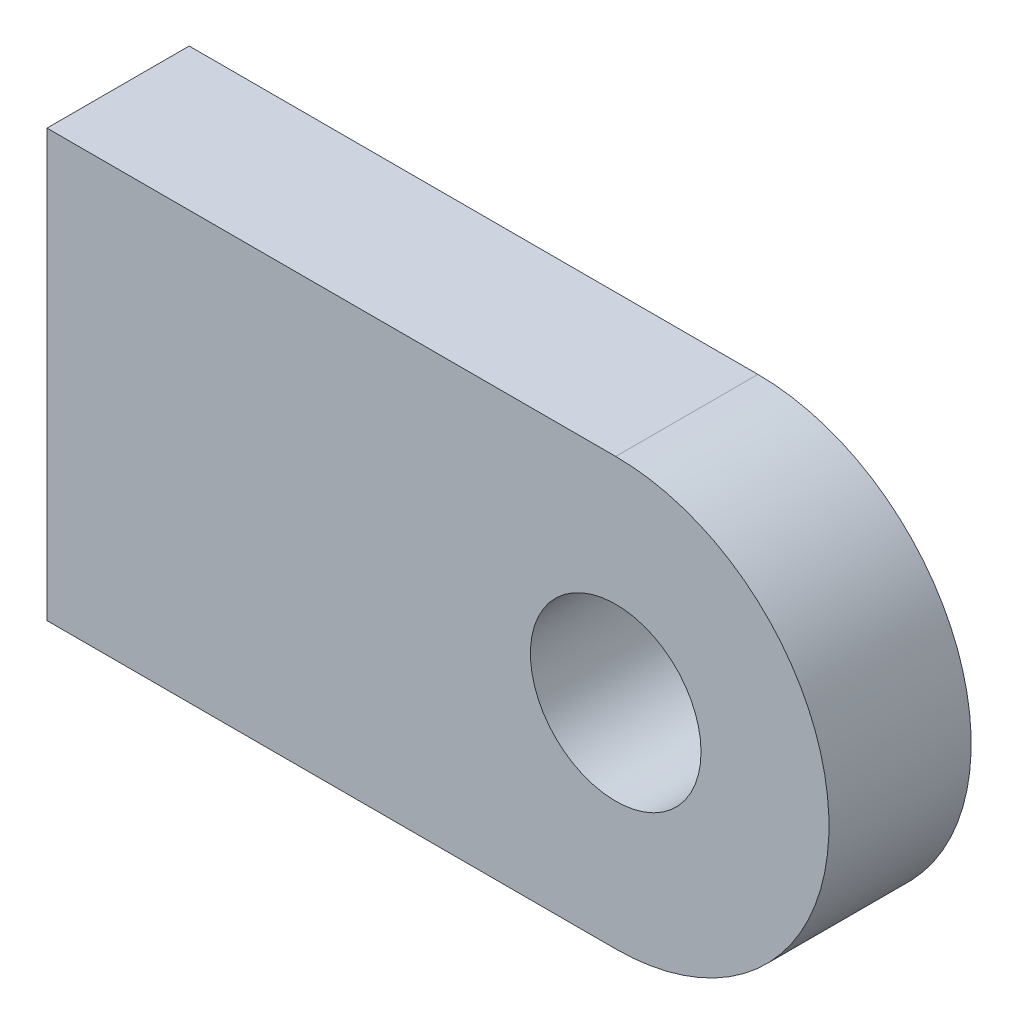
ISO-10303-21;
HEADER;
FILE_DESCRIPTION(('STEP AP214'),'2;1');
FILE_NAME('part.step','',(''),(''),'','','');
FILE_SCHEMA(('AUTOMOTIVE_DESIGN { 1 0 10303 214 1 1 1 1 }'));
ENDSEC;
DATA;
#1=APPLICATION_CONTEXT('core data for automotive mechanical design processes');
#2=APPLICATION_PROTOCOL_DEFINITION('international standard','automotive_design',2000,#1);
#3=PRODUCT_CONTEXT('',#1,'mechanical');
#4=PRODUCT('Part','Part','',(#3));
#5=PRODUCT_RELATED_PRODUCT_CATEGORY('part','',(#4));
#6=PRODUCT_DEFINITION_FORMATION('','',#4);
#7=PRODUCT_DEFINITION_CONTEXT('part definition',#1,'design');
#8=PRODUCT_DEFINITION('design','',#6,#7);
#9=PRODUCT_DEFINITION_SHAPE('','',#8);
#10=(LENGTH_UNIT() NAMED_UNIT(*) SI_UNIT(.MILLI.,.METRE.));
#11=(NAMED_UNIT(*) PLANE_ANGLE_UNIT() SI_UNIT($,.RADIAN.));
#12=(NAMED_UNIT(*) SI_UNIT($,.STERADIAN.) SOLID_ANGLE_UNIT());
#13=UNCERTAINTY_MEASURE_WITH_UNIT(LENGTH_MEASURE(1.E-05),#10,'distance_accuracy_value','');
#14=(GEOMETRIC_REPRESENTATION_CONTEXT(3) GLOBAL_UNCERTAINTY_ASSIGNED_CONTEXT((#13)) GLOBAL_UNIT_ASSIGNED_CONTEXT((#10,
#11,#12)) REPRESENTATION_CONTEXT('',''));
#15=CARTESIAN_POINT('',(0.,0.,0.));
#16=DIRECTION('',(0.,0.,1.));
#17=DIRECTION('',(1.,0.,0.));
#18=AXIS2_PLACEMENT_3D('',#15,#16,#17);
#19=CARTESIAN_POINT('',(0.,0.,10.));
#20=DIRECTION('',(1.,0.,0.));
#21=DIRECTION('',(0.,1.,0.));
#22=AXIS2_PLACEMENT_3D('',#19,#20,#21);
#23=PLANE('',#22);
#24=DIRECTION('',(0.,-1.,0.));
#25=VECTOR('',#24,1.);
#26=CARTESIAN_POINT('',(0.,0.,0.));
#27=LINE('',#26,#25);
#28=CARTESIAN_POINT('',(0.,0.,0.));
#29=VERTEX_POINT('',#28);
#30=CARTESIAN_POINT('',(0.,-30.,0.));
#31=VERTEX_POINT('',#30);
#32=EDGE_CURVE('E93',#29,#31,#27,.T.);
#33=ORIENTED_EDGE('',*,*,#32,.T.);
#34=DIRECTION('',(0.,0.,-1.));
#35=VECTOR('',#34,1.);
#36=CARTESIAN_POINT('',(0.,-30.,10.));
#37=LINE('',#36,#35);
#38=CARTESIAN_POINT('',(0.,-30.,10.));
#39=VERTEX_POINT('',#38);
#40=EDGE_CURVE('E11',#39,#31,#37,.T.);
#41=ORIENTED_EDGE('',*,*,#40,.F.);
#42=DIRECTION('',(0.,-1.,0.));
#43=VECTOR('',#42,1.);
#44=CARTESIAN_POINT('',(0.,0.,10.));
#45=LINE('',#44,#43);
#46=CARTESIAN_POINT('',(0.,0.,10.));
#47=VERTEX_POINT('',#46);
#48=EDGE_CURVE('E81',#47,#39,#45,.T.);
#49=ORIENTED_EDGE('',*,*,#48,.F.);
#50=DIRECTION('',(0.,0.,-1.));
#51=VECTOR('',#50,1.);
#52=CARTESIAN_POINT('',(0.,0.,10.));
#53=LINE('',#52,#51);
#54=EDGE_CURVE('E89',#47,#29,#53,.T.);
#55=ORIENTED_EDGE('',*,*,#54,.T.);
#56=EDGE_LOOP('',(#33,#41,#49,#55));
#57=FACE_BOUND('',#56,.T.);
#58=ADVANCED_FACE('F30',(#57),#23,.F.);
#59=CARTESIAN_POINT('',(0.,-30.,10.));
#60=DIRECTION('',(0.,1.,0.));
#61=DIRECTION('',(0.,0.,1.));
#62=AXIS2_PLACEMENT_3D('',#59,#60,#61);
#63=PLANE('',#62);
#64=DIRECTION('',(1.,0.,0.));
#65=VECTOR('',#64,1.);
#66=CARTESIAN_POINT('',(0.,-30.,0.));
#67=LINE('',#66,#65);
#68=CARTESIAN_POINT('',(40.,-30.,0.));
#69=VERTEX_POINT('',#68);
#70=EDGE_CURVE('E85',#31,#69,#67,.T.);
#71=ORIENTED_EDGE('',*,*,#70,.T.);
#72=DIRECTION('',(0.,0.,-1.));
#73=VECTOR('',#72,1.);
#74=CARTESIAN_POINT('',(40.,-30.,10.));
#75=LINE('',#74,#73);
#76=CARTESIAN_POINT('',(40.,-30.,10.));
#77=VERTEX_POINT('',#76);
#78=EDGE_CURVE('E38',#77,#69,#75,.T.);
#79=ORIENTED_EDGE('',*,*,#78,.F.);
#80=DIRECTION('',(1.,0.,0.));
#81=VECTOR('',#80,1.);
#82=CARTESIAN_POINT('',(0.,-30.,10.));
#83=LINE('',#82,#81);
#84=EDGE_CURVE('E76',#39,#77,#83,.T.);
#85=ORIENTED_EDGE('',*,*,#84,.F.);
#86=ORIENTED_EDGE('',*,*,#40,.T.);
#87=EDGE_LOOP('',(#71,#79,#85,#86));
#88=FACE_BOUND('',#87,.T.);
#89=ADVANCED_FACE('F84',(#88),#63,.F.);
#90=CARTESIAN_POINT('',(40.,-15.,10.));
#91=DIRECTION('',(0.,0.,-1.));
#92=DIRECTION('',(-1.,0.,0.));
#93=AXIS2_PLACEMENT_3D('',#90,#91,#92);
#94=CYLINDRICAL_SURFACE('',#93,15.);
#95=CARTESIAN_POINT('',(40.,-15.,0.));
#96=DIRECTION('',(0.,0.,1.));
#97=DIRECTION('',(1.,0.,0.));
#98=AXIS2_PLACEMENT_3D('',#95,#96,#97);
#99=CIRCLE('',#98,15.);
#100=CARTESIAN_POINT('',(40.,0.,0.));
#101=VERTEX_POINT('',#100);
#102=EDGE_CURVE('E63',#69,#101,#99,.T.);
#103=ORIENTED_EDGE('',*,*,#102,.T.);
#104=DIRECTION('',(0.,0.,-1.));
#105=VECTOR('',#104,1.);
#106=CARTESIAN_POINT('',(40.,0.,10.));
#107=LINE('',#106,#105);
#108=CARTESIAN_POINT('',(40.,0.,10.));
#109=VERTEX_POINT('',#108);
#110=EDGE_CURVE('E86',#109,#101,#107,.T.);
#111=ORIENTED_EDGE('',*,*,#110,.F.);
#112=CARTESIAN_POINT('',(40.,-15.,10.));
#113=DIRECTION('',(0.,0.,1.));
#114=DIRECTION('',(1.,0.,0.));
#115=AXIS2_PLACEMENT_3D('',#112,#113,#114);
#116=CIRCLE('',#115,15.);
#117=EDGE_CURVE('E79',#77,#109,#116,.T.);
#118=ORIENTED_EDGE('',*,*,#117,.F.);
#119=ORIENTED_EDGE('',*,*,#78,.T.);
#120=EDGE_LOOP('',(#103,#111,#118,#119));
#121=FACE_BOUND('',#120,.T.);
#122=ADVANCED_FACE('F87',(#121),#94,.T.);
#123=CARTESIAN_POINT('',(0.,0.,10.));
#124=DIRECTION('',(0.,-1.,0.));
#125=DIRECTION('',(0.,0.,-1.));
#126=AXIS2_PLACEMENT_3D('',#123,#124,#125);
#127=PLANE('',#126);
#128=DIRECTION('',(-1.,0.,0.));
#129=VECTOR('',#128,1.);
#130=CARTESIAN_POINT('',(0.,0.,0.));
#131=LINE('',#130,#129);
#132=EDGE_CURVE('E69',#101,#29,#131,.T.);
#133=ORIENTED_EDGE('',*,*,#132,.T.);
#134=ORIENTED_EDGE('',*,*,#54,.F.);
#135=DIRECTION('',(-1.,0.,0.));
#136=VECTOR('',#135,1.);
#137=CARTESIAN_POINT('',(0.,0.,10.));
#138=LINE('',#137,#136);
#139=EDGE_CURVE('E46',#109,#47,#138,.T.);
#140=ORIENTED_EDGE('',*,*,#139,.F.);
#141=ORIENTED_EDGE('',*,*,#110,.T.);
#142=EDGE_LOOP('',(#133,#134,#140,#141));
#143=FACE_BOUND('',#142,.T.);
#144=ADVANCED_FACE('F101',(#143),#127,.F.);
#145=CARTESIAN_POINT('',(40.,-15.,10.));
#146=DIRECTION('',(0.,0.,1.));
#147=DIRECTION('',(1.,0.,0.));
#148=AXIS2_PLACEMENT_3D('',#145,#146,#147);
#149=PLANE('',#148);
#150=CARTESIAN_POINT('',(40.,-15.,10.));
#151=DIRECTION('',(0.,0.,1.));
#152=DIRECTION('',(1.,0.,0.));
#153=AXIS2_PLACEMENT_3D('',#150,#151,#152);
#154=CIRCLE('',#153,6.);
#155=CARTESIAN_POINT('',(46.,-15.,10.));
#156=VERTEX_POINT('',#155);
#157=EDGE_CURVE('E107',#156,#156,#154,.T.);
#158=ORIENTED_EDGE('',*,*,#157,.F.);
#159=EDGE_LOOP('',(#158));
#160=FACE_BOUND('',#159,.T.);
#161=ORIENTED_EDGE('',*,*,#48,.T.);
#162=ORIENTED_EDGE('',*,*,#84,.T.);
#163=ORIENTED_EDGE('',*,*,#117,.T.);
#164=ORIENTED_EDGE('',*,*,#139,.T.);
#165=EDGE_LOOP('',(#161,#162,#163,#164));
#166=FACE_BOUND('',#165,.T.);
#167=ADVANCED_FACE('F77',(#160,#166),#149,.T.);
#168=CARTESIAN_POINT('',(40.,-15.,0.));
#169=DIRECTION('',(0.,0.,1.));
#170=DIRECTION('',(1.,0.,0.));
#171=AXIS2_PLACEMENT_3D('',#168,#169,#170);
#172=PLANE('',#171);
#173=CARTESIAN_POINT('',(40.,-15.,0.));
#174=DIRECTION('',(0.,0.,1.));
#175=DIRECTION('',(1.,0.,0.));
#176=AXIS2_PLACEMENT_3D('',#173,#174,#175);
#177=CIRCLE('',#176,6.);
#178=CARTESIAN_POINT('',(46.,-15.,0.));
#179=VERTEX_POINT('',#178);
#180=EDGE_CURVE('E96',#179,#179,#177,.T.);
#181=ORIENTED_EDGE('',*,*,#180,.T.);
#182=EDGE_LOOP('',(#181));
#183=FACE_BOUND('',#182,.T.);
#184=ORIENTED_EDGE('',*,*,#32,.F.);
#185=ORIENTED_EDGE('',*,*,#132,.F.);
#186=ORIENTED_EDGE('',*,*,#102,.F.);
#187=ORIENTED_EDGE('',*,*,#70,.F.);
#188=EDGE_LOOP('',(#184,#185,#186,#187));
#189=FACE_BOUND('',#188,.T.);
#190=ADVANCED_FACE('F104',(#183,#189),#172,.F.);
#191=CARTESIAN_POINT('',(40.,-15.,0.));
#192=DIRECTION('',(0.,0.,1.));
#193=DIRECTION('',(1.,0.,0.));
#194=AXIS2_PLACEMENT_3D('',#191,#192,#193);
#195=CYLINDRICAL_SURFACE('',#194,6.);
#196=ORIENTED_EDGE('',*,*,#180,.F.);
#197=EDGE_LOOP('',(#196));
#198=FACE_BOUND('',#197,.T.);
#199=ORIENTED_EDGE('',*,*,#157,.T.);
#200=EDGE_LOOP('',(#199));
#201=FACE_BOUND('',#200,.T.);
#202=ADVANCED_FACE('F114',(#198,#201),#195,.F.);
#203=CLOSED_SHELL('',(#58,#89,#122,#144,#167,#190,#202));
#204=MANIFOLD_SOLID_BREP('B2',#203);
#205=ADVANCED_BREP_SHAPE_REPRESENTATION('',(#18,#204),#14);
#206=SHAPE_DEFINITION_REPRESENTATION(#9,#205);
ENDSEC;
END-ISO-10303-21;
